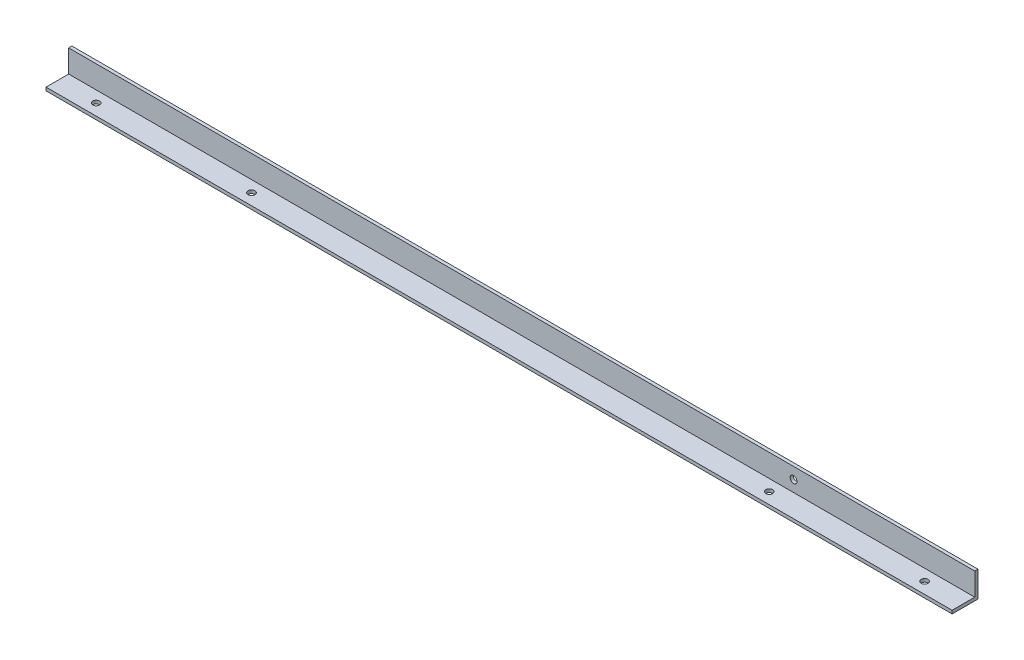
ISO-10303-21;
HEADER;
FILE_DESCRIPTION(('STEP AP214'),'2;1');
FILE_NAME('part.step','',(''),(''),'','','');
FILE_SCHEMA(('AUTOMOTIVE_DESIGN { 1 0 10303 214 1 1 1 1 }'));
ENDSEC;
DATA;
#1=APPLICATION_CONTEXT('core data for automotive mechanical design processes');
#2=APPLICATION_PROTOCOL_DEFINITION('international standard','automotive_design',2000,#1);
#3=PRODUCT_CONTEXT('',#1,'mechanical');
#4=PRODUCT('Part','Part','',(#3));
#5=PRODUCT_RELATED_PRODUCT_CATEGORY('part','',(#4));
#6=PRODUCT_DEFINITION_FORMATION('','',#4);
#7=PRODUCT_DEFINITION_CONTEXT('part definition',#1,'design');
#8=PRODUCT_DEFINITION('design','',#6,#7);
#9=PRODUCT_DEFINITION_SHAPE('','',#8);
#10=(LENGTH_UNIT() NAMED_UNIT(*) SI_UNIT(.MILLI.,.METRE.));
#11=(NAMED_UNIT(*) PLANE_ANGLE_UNIT() SI_UNIT($,.RADIAN.));
#12=(NAMED_UNIT(*) SI_UNIT($,.STERADIAN.) SOLID_ANGLE_UNIT());
#13=UNCERTAINTY_MEASURE_WITH_UNIT(LENGTH_MEASURE(1.E-05),#10,'distance_accuracy_value','');
#14=(GEOMETRIC_REPRESENTATION_CONTEXT(3) GLOBAL_UNCERTAINTY_ASSIGNED_CONTEXT((#13)) GLOBAL_UNIT_ASSIGNED_CONTEXT((#10,
#11,#12)) REPRESENTATION_CONTEXT('',''));
#15=CARTESIAN_POINT('',(0.,0.,0.));
#16=DIRECTION('',(0.,0.,1.));
#17=DIRECTION('',(1.,0.,0.));
#18=AXIS2_PLACEMENT_3D('',#15,#16,#17);
#19=CARTESIAN_POINT('',(444.5,3.175,-12.7));
#20=DIRECTION('',(-1.,0.,0.));
#21=DIRECTION('',(0.,0.,1.));
#22=AXIS2_PLACEMENT_3D('',#19,#20,#21);
#23=PLANE('',#22);
#24=DIRECTION('',(0.,0.,-1.));
#25=VECTOR('',#24,1.);
#26=CARTESIAN_POINT('',(444.5,0.,-12.7));
#27=LINE('',#26,#25);
#28=CARTESIAN_POINT('',(444.5,0.,12.7));
#29=VERTEX_POINT('',#28);
#30=CARTESIAN_POINT('',(444.5,0.,-12.7));
#31=VERTEX_POINT('',#30);
#32=EDGE_CURVE('E89',#29,#31,#27,.T.);
#33=ORIENTED_EDGE('',*,*,#32,.T.);
#34=DIRECTION('',(0.,-1.,0.));
#35=VECTOR('',#34,1.);
#36=CARTESIAN_POINT('',(444.5,3.175,-12.7));
#37=LINE('',#36,#35);
#38=CARTESIAN_POINT('',(444.5,25.4,-12.7));
#39=VERTEX_POINT('',#38);
#40=EDGE_CURVE('E11',#39,#31,#37,.T.);
#41=ORIENTED_EDGE('',*,*,#40,.F.);
#42=DIRECTION('',(0.,0.,-1.));
#43=VECTOR('',#42,1.);
#44=CARTESIAN_POINT('',(444.5,25.4,-9.525));
#45=LINE('',#44,#43);
#46=CARTESIAN_POINT('',(444.5,25.4,-9.525));
#47=VERTEX_POINT('',#46);
#48=EDGE_CURVE('E115',#47,#39,#45,.T.);
#49=ORIENTED_EDGE('',*,*,#48,.F.);
#50=DIRECTION('',(0.,-1.,0.));
#51=VECTOR('',#50,1.);
#52=CARTESIAN_POINT('',(444.5,25.4,-9.525));
#53=LINE('',#52,#51);
#54=CARTESIAN_POINT('',(444.5,3.175,-9.525));
#55=VERTEX_POINT('',#54);
#56=EDGE_CURVE('E98',#47,#55,#53,.T.);
#57=ORIENTED_EDGE('',*,*,#56,.T.);
#58=DIRECTION('',(0.,0.,-1.));
#59=VECTOR('',#58,1.);
#60=CARTESIAN_POINT('',(444.5,3.175,-12.7));
#61=LINE('',#60,#59);
#62=CARTESIAN_POINT('',(444.5,3.175,12.7));
#63=VERTEX_POINT('',#62);
#64=EDGE_CURVE('E83',#63,#55,#61,.T.);
#65=ORIENTED_EDGE('',*,*,#64,.F.);
#66=DIRECTION('',(0.,-1.,0.));
#67=VECTOR('',#66,1.);
#68=CARTESIAN_POINT('',(444.5,3.175,12.7));
#69=LINE('',#68,#67);
#70=EDGE_CURVE('E76',#63,#29,#69,.T.);
#71=ORIENTED_EDGE('',*,*,#70,.T.);
#72=EDGE_LOOP('',(#33,#41,#49,#57,#65,#71));
#73=FACE_BOUND('',#72,.T.);
#74=ADVANCED_FACE('F32',(#73),#23,.F.);
#75=CARTESIAN_POINT('',(-444.5,3.175,-12.7));
#76=DIRECTION('',(0.,0.,1.));
#77=DIRECTION('',(1.,0.,0.));
#78=AXIS2_PLACEMENT_3D('',#75,#76,#77);
#79=PLANE('',#78);
#80=CARTESIAN_POINT('',(266.7,14.2875,-12.7));
#81=DIRECTION('',(0.,0.,1.));
#82=DIRECTION('',(1.,0.,0.));
#83=AXIS2_PLACEMENT_3D('',#80,#81,#82);
#84=CIRCLE('',#83,3.37819999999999);
#85=CARTESIAN_POINT('',(270.0782,14.2875,-12.7));
#86=VERTEX_POINT('',#85);
#87=EDGE_CURVE('E159',#86,#86,#84,.T.);
#88=ORIENTED_EDGE('',*,*,#87,.T.);
#89=EDGE_LOOP('',(#88));
#90=FACE_BOUND('',#89,.T.);
#91=DIRECTION('',(-1.,0.,0.));
#92=VECTOR('',#91,1.);
#93=CARTESIAN_POINT('',(-444.5,0.,-12.7));
#94=LINE('',#93,#92);
#95=CARTESIAN_POINT('',(-444.5,0.,-12.7));
#96=VERTEX_POINT('',#95);
#97=EDGE_CURVE('E93',#31,#96,#94,.T.);
#98=ORIENTED_EDGE('',*,*,#97,.T.);
#99=DIRECTION('',(0.,-1.,0.));
#100=VECTOR('',#99,1.);
#101=CARTESIAN_POINT('',(-444.5,3.175,-12.7));
#102=LINE('',#101,#100);
#103=CARTESIAN_POINT('',(-444.5,25.4,-12.7));
#104=VERTEX_POINT('',#103);
#105=EDGE_CURVE('E40',#104,#96,#102,.T.);
#106=ORIENTED_EDGE('',*,*,#105,.F.);
#107=DIRECTION('',(-1.,0.,0.));
#108=VECTOR('',#107,1.);
#109=CARTESIAN_POINT('',(444.5,25.4,-12.7));
#110=LINE('',#109,#108);
#111=EDGE_CURVE('E118',#39,#104,#110,.T.);
#112=ORIENTED_EDGE('',*,*,#111,.F.);
#113=ORIENTED_EDGE('',*,*,#40,.T.);
#114=EDGE_LOOP('',(#98,#106,#112,#113));
#115=FACE_BOUND('',#114,.T.);
#116=ADVANCED_FACE('F168',(#90,#115),#79,.F.);
#117=CARTESIAN_POINT('',(-444.5,3.175,-12.7));
#118=DIRECTION('',(1.,0.,0.));
#119=DIRECTION('',(0.,0.,-1.));
#120=AXIS2_PLACEMENT_3D('',#117,#118,#119);
#121=PLANE('',#120);
#122=DIRECTION('',(0.,0.,1.));
#123=VECTOR('',#122,1.);
#124=CARTESIAN_POINT('',(-444.5,0.,-12.7));
#125=LINE('',#124,#123);
#126=CARTESIAN_POINT('',(-444.5,0.,12.7));
#127=VERTEX_POINT('',#126);
#128=EDGE_CURVE('E84',#96,#127,#125,.T.);
#129=ORIENTED_EDGE('',*,*,#128,.T.);
#130=DIRECTION('',(0.,-1.,0.));
#131=VECTOR('',#130,1.);
#132=CARTESIAN_POINT('',(-444.5,3.175,12.7));
#133=LINE('',#132,#131);
#134=CARTESIAN_POINT('',(-444.5,3.175,12.7));
#135=VERTEX_POINT('',#134);
#136=EDGE_CURVE('E79',#135,#127,#133,.T.);
#137=ORIENTED_EDGE('',*,*,#136,.F.);
#138=DIRECTION('',(0.,0.,1.));
#139=VECTOR('',#138,1.);
#140=CARTESIAN_POINT('',(-444.5,3.175,-12.7));
#141=LINE('',#140,#139);
#142=CARTESIAN_POINT('',(-444.5,3.175,-9.525));
#143=VERTEX_POINT('',#142);
#144=EDGE_CURVE('E108',#143,#135,#141,.T.);
#145=ORIENTED_EDGE('',*,*,#144,.F.);
#146=DIRECTION('',(0.,-1.,0.));
#147=VECTOR('',#146,1.);
#148=CARTESIAN_POINT('',(-444.5,25.4,-9.525));
#149=LINE('',#148,#147);
#150=CARTESIAN_POINT('',(-444.5,25.4,-9.525));
#151=VERTEX_POINT('',#150);
#152=EDGE_CURVE('E94',#151,#143,#149,.T.);
#153=ORIENTED_EDGE('',*,*,#152,.F.);
#154=DIRECTION('',(0.,0.,1.));
#155=VECTOR('',#154,1.);
#156=CARTESIAN_POINT('',(-444.5,25.4,-12.7));
#157=LINE('',#156,#155);
#158=EDGE_CURVE('E131',#104,#151,#157,.T.);
#159=ORIENTED_EDGE('',*,*,#158,.F.);
#160=ORIENTED_EDGE('',*,*,#105,.T.);
#161=EDGE_LOOP('',(#129,#137,#145,#153,#159,#160));
#162=FACE_BOUND('',#161,.T.);
#163=ADVANCED_FACE('F193',(#162),#121,.F.);
#164=CARTESIAN_POINT('',(-444.5,3.175,12.7));
#165=DIRECTION('',(0.,0.,-1.));
#166=DIRECTION('',(-1.,0.,0.));
#167=AXIS2_PLACEMENT_3D('',#164,#165,#166);
#168=PLANE('',#167);
#169=DIRECTION('',(1.,0.,0.));
#170=VECTOR('',#169,1.);
#171=CARTESIAN_POINT('',(-444.5,0.,12.7));
#172=LINE('',#171,#170);
#173=EDGE_CURVE('E73',#127,#29,#172,.T.);
#174=ORIENTED_EDGE('',*,*,#173,.T.);
#175=ORIENTED_EDGE('',*,*,#70,.F.);
#176=DIRECTION('',(1.,0.,0.));
#177=VECTOR('',#176,1.);
#178=CARTESIAN_POINT('',(-444.5,3.175,12.7));
#179=LINE('',#178,#177);
#180=EDGE_CURVE('E54',#135,#63,#179,.T.);
#181=ORIENTED_EDGE('',*,*,#180,.F.);
#182=ORIENTED_EDGE('',*,*,#136,.T.);
#183=EDGE_LOOP('',(#174,#175,#181,#182));
#184=FACE_BOUND('',#183,.T.);
#185=ADVANCED_FACE('F75',(#184),#168,.F.);
#186=CARTESIAN_POINT('',(444.5,3.175,12.7));
#187=DIRECTION('',(0.,1.,0.));
#188=DIRECTION('',(0.,0.,1.));
#189=AXIS2_PLACEMENT_3D('',#186,#187,#188);
#190=PLANE('',#189);
#191=CARTESIAN_POINT('',(254.,3.175,1.5875));
#192=DIRECTION('',(0.,1.,0.));
#193=DIRECTION('',(0.,0.,1.));
#194=AXIS2_PLACEMENT_3D('',#191,#192,#193);
#195=CIRCLE('',#194,3.37819999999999);
#196=CARTESIAN_POINT('',(254.,3.175,4.96569999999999));
#197=VERTEX_POINT('',#196);
#198=EDGE_CURVE('E156',#197,#197,#195,.T.);
#199=ORIENTED_EDGE('',*,*,#198,.F.);
#200=EDGE_LOOP('',(#199));
#201=FACE_BOUND('',#200,.T.);
#202=CARTESIAN_POINT('',(406.4,3.175,1.5875));
#203=DIRECTION('',(0.,1.,0.));
#204=DIRECTION('',(0.,0.,1.));
#205=AXIS2_PLACEMENT_3D('',#202,#203,#204);
#206=CIRCLE('',#205,3.37819999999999);
#207=CARTESIAN_POINT('',(406.4,3.175,4.96569999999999));
#208=VERTEX_POINT('',#207);
#209=EDGE_CURVE('E150',#208,#208,#206,.T.);
#210=ORIENTED_EDGE('',*,*,#209,.F.);
#211=EDGE_LOOP('',(#210));
#212=FACE_BOUND('',#211,.T.);
#213=CARTESIAN_POINT('',(-254.,3.175,1.5875));
#214=DIRECTION('',(0.,1.,0.));
#215=DIRECTION('',(0.,0.,1.));
#216=AXIS2_PLACEMENT_3D('',#213,#214,#215);
#217=CIRCLE('',#216,3.37819999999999);
#218=CARTESIAN_POINT('',(-254.,3.175,4.96569999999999));
#219=VERTEX_POINT('',#218);
#220=EDGE_CURVE('E144',#219,#219,#217,.T.);
#221=ORIENTED_EDGE('',*,*,#220,.F.);
#222=EDGE_LOOP('',(#221));
#223=FACE_BOUND('',#222,.T.);
#224=CARTESIAN_POINT('',(-406.4,3.175,1.5875));
#225=DIRECTION('',(0.,1.,0.));
#226=DIRECTION('',(0.,0.,1.));
#227=AXIS2_PLACEMENT_3D('',#224,#225,#226);
#228=CIRCLE('',#227,3.37819999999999);
#229=CARTESIAN_POINT('',(-406.4,3.175,4.96569999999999));
#230=VERTEX_POINT('',#229);
#231=EDGE_CURVE('E138',#230,#230,#228,.T.);
#232=ORIENTED_EDGE('',*,*,#231,.F.);
#233=EDGE_LOOP('',(#232));
#234=FACE_BOUND('',#233,.T.);
#235=DIRECTION('',(1.,0.,0.));
#236=VECTOR('',#235,1.);
#237=CARTESIAN_POINT('',(-444.5,3.175,-9.525));
#238=LINE('',#237,#236);
#239=EDGE_CURVE('E48',#143,#55,#238,.T.);
#240=ORIENTED_EDGE('',*,*,#239,.F.);
#241=ORIENTED_EDGE('',*,*,#144,.T.);
#242=ORIENTED_EDGE('',*,*,#180,.T.);
#243=ORIENTED_EDGE('',*,*,#64,.T.);
#244=EDGE_LOOP('',(#240,#241,#242,#243));
#245=FACE_BOUND('',#244,.T.);
#246=ADVANCED_FACE('F194',(#201,#212,#223,#234,#245),#190,.T.);
#247=CARTESIAN_POINT('',(444.5,0.,12.7));
#248=DIRECTION('',(0.,1.,0.));
#249=DIRECTION('',(0.,0.,1.));
#250=AXIS2_PLACEMENT_3D('',#247,#248,#249);
#251=PLANE('',#250);
#252=CARTESIAN_POINT('',(254.,0.,1.5875));
#253=DIRECTION('',(0.,1.,0.));
#254=DIRECTION('',(0.,0.,1.));
#255=AXIS2_PLACEMENT_3D('',#252,#253,#254);
#256=CIRCLE('',#255,3.37819999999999);
#257=CARTESIAN_POINT('',(254.,0.,4.96569999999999));
#258=VERTEX_POINT('',#257);
#259=EDGE_CURVE('E153',#258,#258,#256,.T.);
#260=ORIENTED_EDGE('',*,*,#259,.T.);
#261=EDGE_LOOP('',(#260));
#262=FACE_BOUND('',#261,.T.);
#263=CARTESIAN_POINT('',(406.4,0.,1.5875));
#264=DIRECTION('',(0.,1.,0.));
#265=DIRECTION('',(0.,0.,1.));
#266=AXIS2_PLACEMENT_3D('',#263,#264,#265);
#267=CIRCLE('',#266,3.37819999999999);
#268=CARTESIAN_POINT('',(406.4,0.,4.96569999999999));
#269=VERTEX_POINT('',#268);
#270=EDGE_CURVE('E147',#269,#269,#267,.T.);
#271=ORIENTED_EDGE('',*,*,#270,.T.);
#272=EDGE_LOOP('',(#271));
#273=FACE_BOUND('',#272,.T.);
#274=CARTESIAN_POINT('',(-254.,0.,1.5875));
#275=DIRECTION('',(0.,1.,0.));
#276=DIRECTION('',(0.,0.,1.));
#277=AXIS2_PLACEMENT_3D('',#274,#275,#276);
#278=CIRCLE('',#277,3.37819999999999);
#279=CARTESIAN_POINT('',(-254.,0.,4.96569999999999));
#280=VERTEX_POINT('',#279);
#281=EDGE_CURVE('E141',#280,#280,#278,.T.);
#282=ORIENTED_EDGE('',*,*,#281,.T.);
#283=EDGE_LOOP('',(#282));
#284=FACE_BOUND('',#283,.T.);
#285=CARTESIAN_POINT('',(-406.4,0.,1.5875));
#286=DIRECTION('',(0.,1.,0.));
#287=DIRECTION('',(0.,0.,1.));
#288=AXIS2_PLACEMENT_3D('',#285,#286,#287);
#289=CIRCLE('',#288,3.37819999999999);
#290=CARTESIAN_POINT('',(-406.4,0.,4.96569999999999));
#291=VERTEX_POINT('',#290);
#292=EDGE_CURVE('E119',#291,#291,#289,.T.);
#293=ORIENTED_EDGE('',*,*,#292,.T.);
#294=EDGE_LOOP('',(#293));
#295=FACE_BOUND('',#294,.T.);
#296=ORIENTED_EDGE('',*,*,#32,.F.);
#297=ORIENTED_EDGE('',*,*,#173,.F.);
#298=ORIENTED_EDGE('',*,*,#128,.F.);
#299=ORIENTED_EDGE('',*,*,#97,.F.);
#300=EDGE_LOOP('',(#296,#297,#298,#299));
#301=FACE_BOUND('',#300,.T.);
#302=ADVANCED_FACE('F92',(#262,#273,#284,#295,#301),#251,.F.);
#303=CARTESIAN_POINT('',(-444.5,25.4,-9.525));
#304=DIRECTION('',(0.,0.,-1.));
#305=DIRECTION('',(-1.,0.,0.));
#306=AXIS2_PLACEMENT_3D('',#303,#304,#305);
#307=PLANE('',#306);
#308=CARTESIAN_POINT('',(266.7,14.2875,-9.525));
#309=DIRECTION('',(0.,0.,1.));
#310=DIRECTION('',(1.,0.,0.));
#311=AXIS2_PLACEMENT_3D('',#308,#309,#310);
#312=CIRCLE('',#311,3.37819999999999);
#313=CARTESIAN_POINT('',(270.0782,14.2875,-9.525));
#314=VERTEX_POINT('',#313);
#315=EDGE_CURVE('E162',#314,#314,#312,.T.);
#316=ORIENTED_EDGE('',*,*,#315,.F.);
#317=EDGE_LOOP('',(#316));
#318=FACE_BOUND('',#317,.T.);
#319=ORIENTED_EDGE('',*,*,#239,.T.);
#320=ORIENTED_EDGE('',*,*,#56,.F.);
#321=DIRECTION('',(1.,0.,0.));
#322=VECTOR('',#321,1.);
#323=CARTESIAN_POINT('',(-444.5,25.4,-9.525));
#324=LINE('',#323,#322);
#325=EDGE_CURVE('E126',#151,#47,#324,.T.);
#326=ORIENTED_EDGE('',*,*,#325,.F.);
#327=ORIENTED_EDGE('',*,*,#152,.T.);
#328=EDGE_LOOP('',(#319,#320,#326,#327));
#329=FACE_BOUND('',#328,.T.);
#330=ADVANCED_FACE('F178',(#318,#329),#307,.F.);
#331=CARTESIAN_POINT('',(-444.5,25.4,-12.7));
#332=DIRECTION('',(0.,1.,0.));
#333=DIRECTION('',(0.,0.,1.));
#334=AXIS2_PLACEMENT_3D('',#331,#332,#333);
#335=PLANE('',#334);
#336=ORIENTED_EDGE('',*,*,#111,.T.);
#337=ORIENTED_EDGE('',*,*,#158,.T.);
#338=ORIENTED_EDGE('',*,*,#325,.T.);
#339=ORIENTED_EDGE('',*,*,#48,.T.);
#340=EDGE_LOOP('',(#336,#337,#338,#339));
#341=FACE_BOUND('',#340,.T.);
#342=ADVANCED_FACE('F181',(#341),#335,.T.);
#343=CARTESIAN_POINT('',(-406.4,0.,1.5875));
#344=DIRECTION('',(0.,1.,0.));
#345=DIRECTION('',(0.,0.,1.));
#346=AXIS2_PLACEMENT_3D('',#343,#344,#345);
#347=CYLINDRICAL_SURFACE('',#346,3.37819999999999);
#348=ORIENTED_EDGE('',*,*,#292,.F.);
#349=EDGE_LOOP('',(#348));
#350=FACE_BOUND('',#349,.T.);
#351=ORIENTED_EDGE('',*,*,#231,.T.);
#352=EDGE_LOOP('',(#351));
#353=FACE_BOUND('',#352,.T.);
#354=ADVANCED_FACE('F262',(#350,#353),#347,.F.);
#355=CARTESIAN_POINT('',(-254.,0.,1.5875));
#356=DIRECTION('',(0.,1.,0.));
#357=DIRECTION('',(0.,0.,1.));
#358=AXIS2_PLACEMENT_3D('',#355,#356,#357);
#359=CYLINDRICAL_SURFACE('',#358,3.37819999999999);
#360=ORIENTED_EDGE('',*,*,#281,.F.);
#361=EDGE_LOOP('',(#360));
#362=FACE_BOUND('',#361,.T.);
#363=ORIENTED_EDGE('',*,*,#220,.T.);
#364=EDGE_LOOP('',(#363));
#365=FACE_BOUND('',#364,.T.);
#366=ADVANCED_FACE('F270',(#362,#365),#359,.F.);
#367=CARTESIAN_POINT('',(406.4,0.,1.5875));
#368=DIRECTION('',(0.,1.,0.));
#369=DIRECTION('',(0.,0.,1.));
#370=AXIS2_PLACEMENT_3D('',#367,#368,#369);
#371=CYLINDRICAL_SURFACE('',#370,3.37819999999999);
#372=ORIENTED_EDGE('',*,*,#270,.F.);
#373=EDGE_LOOP('',(#372));
#374=FACE_BOUND('',#373,.T.);
#375=ORIENTED_EDGE('',*,*,#209,.T.);
#376=EDGE_LOOP('',(#375));
#377=FACE_BOUND('',#376,.T.);
#378=ADVANCED_FACE('F279',(#374,#377),#371,.F.);
#379=CARTESIAN_POINT('',(254.,0.,1.5875));
#380=DIRECTION('',(0.,1.,0.));
#381=DIRECTION('',(0.,0.,1.));
#382=AXIS2_PLACEMENT_3D('',#379,#380,#381);
#383=CYLINDRICAL_SURFACE('',#382,3.37819999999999);
#384=ORIENTED_EDGE('',*,*,#259,.F.);
#385=EDGE_LOOP('',(#384));
#386=FACE_BOUND('',#385,.T.);
#387=ORIENTED_EDGE('',*,*,#198,.T.);
#388=EDGE_LOOP('',(#387));
#389=FACE_BOUND('',#388,.T.);
#390=ADVANCED_FACE('F174',(#386,#389),#383,.F.);
#391=CARTESIAN_POINT('',(266.7,14.2875,-12.7));
#392=DIRECTION('',(0.,0.,1.));
#393=DIRECTION('',(1.,0.,0.));
#394=AXIS2_PLACEMENT_3D('',#391,#392,#393);
#395=CYLINDRICAL_SURFACE('',#394,3.37819999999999);
#396=ORIENTED_EDGE('',*,*,#87,.F.);
#397=EDGE_LOOP('',(#396));
#398=FACE_BOUND('',#397,.T.);
#399=ORIENTED_EDGE('',*,*,#315,.T.);
#400=EDGE_LOOP('',(#399));
#401=FACE_BOUND('',#400,.T.);
#402=ADVANCED_FACE('F171',(#398,#401),#395,.F.);
#403=CLOSED_SHELL('',(#74,#116,#163,#185,#246,#302,#330,#342,#354,#366,#378,#390,#402));
#404=MANIFOLD_SOLID_BREP('B2',#403);
#405=ADVANCED_BREP_SHAPE_REPRESENTATION('',(#18,#404),#14);
#406=SHAPE_DEFINITION_REPRESENTATION(#9,#405);
ENDSEC;
END-ISO-10303-21;
